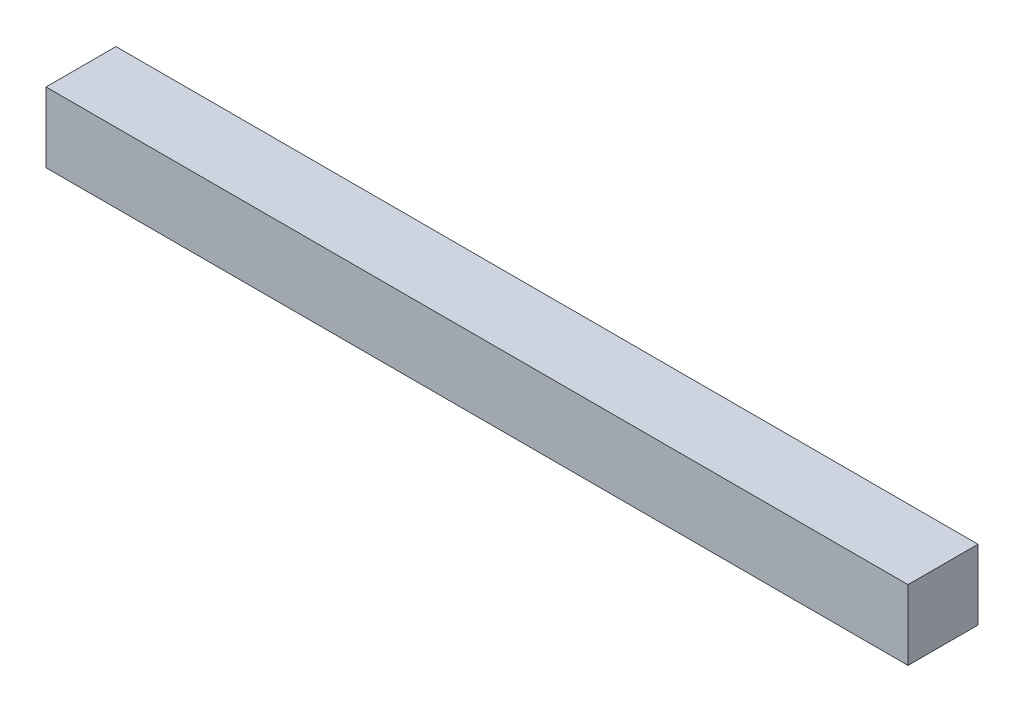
from build123d import *

# Parameters (mm, degrees)
SKETCH1_W           = 24.64
SKETCH1_H           = 2
BOSS_EXTRUDE1_DEPTH = 2


with BuildPart() as part:
    # Sketch1 → Boss-Extrude1 (new body)
    with BuildSketch(Plane.XY):
        with Locations((-0.804879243, -2.668622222)):
            Rectangle(SKETCH1_W, SKETCH1_H)
    extrude(amount=BOSS_EXTRUDE1_DEPTH)


solid = part.part
